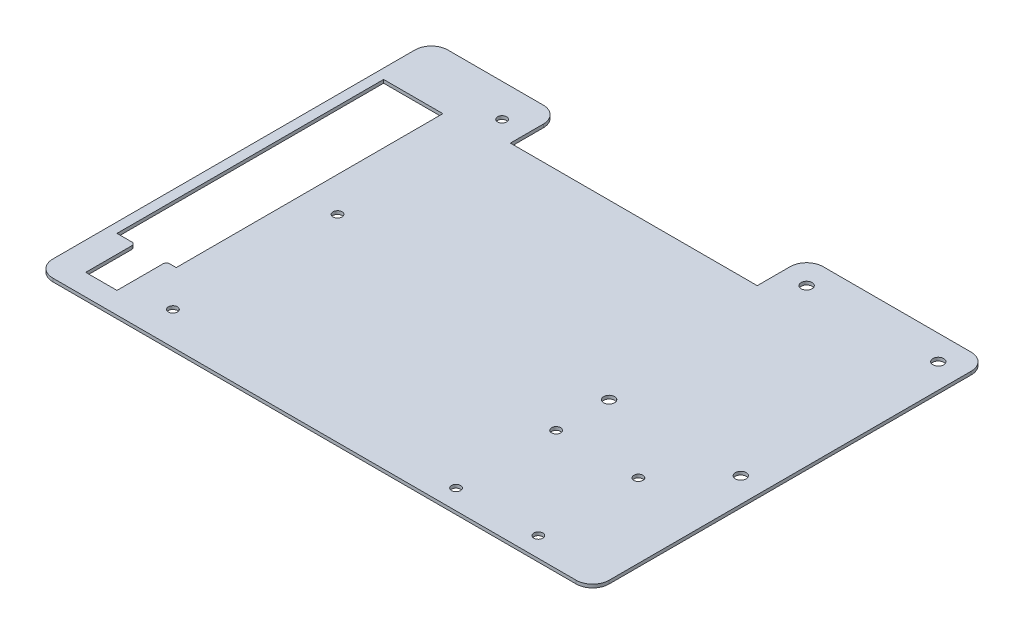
from build123d import *

# Parameters (mm, degrees)
BOSS_EXTRUDE1_DEPTH = 2
SKETCH2_R           = 2.75
CUT_EXTRUDE1_DEPTH  = 201.00999975
SKETCH3_R           = 3.3
SKETCH3_R_2         = 2.75
CUT_EXTRUDE2_DEPTH  = 201.00999975
SKETCH4_W           = 150
SKETCH4_H           = 30
CUT_EXTRUDE3_DEPTH  = 10
FILLET1_R           = 10
SKETCH6_W           = 28
SKETCH6_H           = 240
BOSS_EXTRUDE2_DEPTH = 2
CUT_EXTRUDE5_DEPTH  = 215.681158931
FILLET2_R           = 10


with BuildPart() as part:
    # Sketch1 → Boss-Extrude1 (new body)
    with BuildSketch(Plane(origin=(0, 0, 0), x_dir=(1, 0, 0), z_dir=(0, 1, 0))):
        with BuildLine():
            Line((-150, -120), (150, -120))
            ThreePointArc((150, -120), (157.071067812, -117.071067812), (160, -110))
            Line((160, -110), (160, 110))
            ThreePointArc((160, 110), (157.071067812, 117.071067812), (150, 120))
            Line((150, 120), (-150, 120))
            ThreePointArc((-150, 120), (-157.071067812, 117.071067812), (-160, 110))
            Line((-160, 110), (-160, -110))
            ThreePointArc((-160, -110), (-157.071067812, -117.071067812), (-150, -120))
        make_face()
    extrude(amount=BOSS_EXTRUDE1_DEPTH)

    # Sketch2 → Cut-Extrude1 (cut, through all)
    with BuildSketch(Plane(origin=(0, 2, 0), x_dir=(1, 0, 0), z_dir=(0, 1, 0))):
        with Locations(Location((-115, -100, 0), (0, 0, 270))):
            Circle(SKETCH2_R)
        with Locations(Location((-115, 100, 0), (0, 0, 270))):
            Circle(SKETCH2_R)
        with Locations(Location((-115, 0, 0), (0, 0, 270))):
            Circle(SKETCH2_R)
    extrude(amount=-CUT_EXTRUDE1_DEPTH, mode=Mode.SUBTRACT)

    # Sketch3 → Cut-Extrude2 (cut, through all)
    with BuildSketch(Plane(origin=(0, 2, 0), x_dir=(1, 0, 0), z_dir=(0, 1, 0))):
        with Locations(Location((145, 105, 0), (0, 0, 270))):
            Circle(SKETCH3_R)
        with Locations(Location((145, -15, 0), (0, 0, 270))):
            Circle(SKETCH3_R)
        with Locations(Location((65, -15, 0), (0, 0, 270))):
            Circle(SKETCH3_R)
        with Locations(Location((65, 105, 0), (0, 0, 270))):
            Circle(SKETCH3_R)
        with Locations(Location((115, -108, 0), (0, 0, 270))):
            Circle(SKETCH3_R_2)
        with Locations(Location((65, -108, 0), (0, 0, 270))):
            Circle(SKETCH3_R_2)
        with Locations(Location((65, -47.2, 0), (0, 0, 270))):
            Circle(SKETCH3_R_2)
        with Locations(Location((115, -47.2, 0), (0, 0, 270))):
            Circle(SKETCH3_R_2)
    extrude(amount=-CUT_EXTRUDE2_DEPTH, mode=Mode.SUBTRACT)

    # Sketch4 → Cut-Extrude3 (cut)
    with BuildSketch(Plane(origin=(0, 2, 0), x_dir=(1, 0, 0), z_dir=(0, 1, 0))):
        with Locations((-25, 105)):
            Rectangle(SKETCH4_W, SKETCH4_H)
    extrude(amount=-CUT_EXTRUDE3_DEPTH, mode=Mode.SUBTRACT)

    # Fillet1
    fillet1_edges = [part.edges().sort_by_distance(p)[0] for p in [
        (-100, 1, -120),
        (50, 1, -120),
    ]]
    fillet(fillet1_edges, radius=FILLET1_R)

    # Sketch6 → Boss-Extrude2 (add)
    with BuildSketch(Plane(origin=(0, 0, 0), x_dir=(1, 0, 0), z_dir=(0, 1, 0))):
        with Locations((-164, 0)):
            Rectangle(SKETCH6_W, SKETCH6_H)
    extrude(amount=BOSS_EXTRUDE2_DEPTH)

    # Sketch7 → Cut-Extrude5 (cut, through all)
    with BuildSketch(Plane(origin=(0, 2, 0), x_dir=(1, 0, 0), z_dir=(0, 1, 0))):
        with BuildLine():
            Line((-172, -77), (-163, -77))
            ThreePointArc((-163, -77), (-161.585786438, -77.585786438), (-161, -79))
            Line((-161, -79), (-161, -107))
            Line((-161, -107), (-142, -107))
            Line((-142, -107), (-142, -79))
            ThreePointArc((-142, -79), (-141.414213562, -77.585786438), (-140, -77))
            Line((-140, -77), (-136, -77))
            Line((-136, -77), (-136, 85))
            Line((-136, 85), (-172, 85))
            Line((-172, 85), (-172, -77))
        make_face()
    extrude(amount=-CUT_EXTRUDE5_DEPTH, mode=Mode.SUBTRACT)

    # Fillet2
    fillet2_edges = [part.edges().sort_by_distance(p)[0] for p in [
        (-178, 1, -120),
        (-178, 1, 120),
    ]]
    fillet(fillet2_edges, radius=FILLET2_R)


solid = part.part
